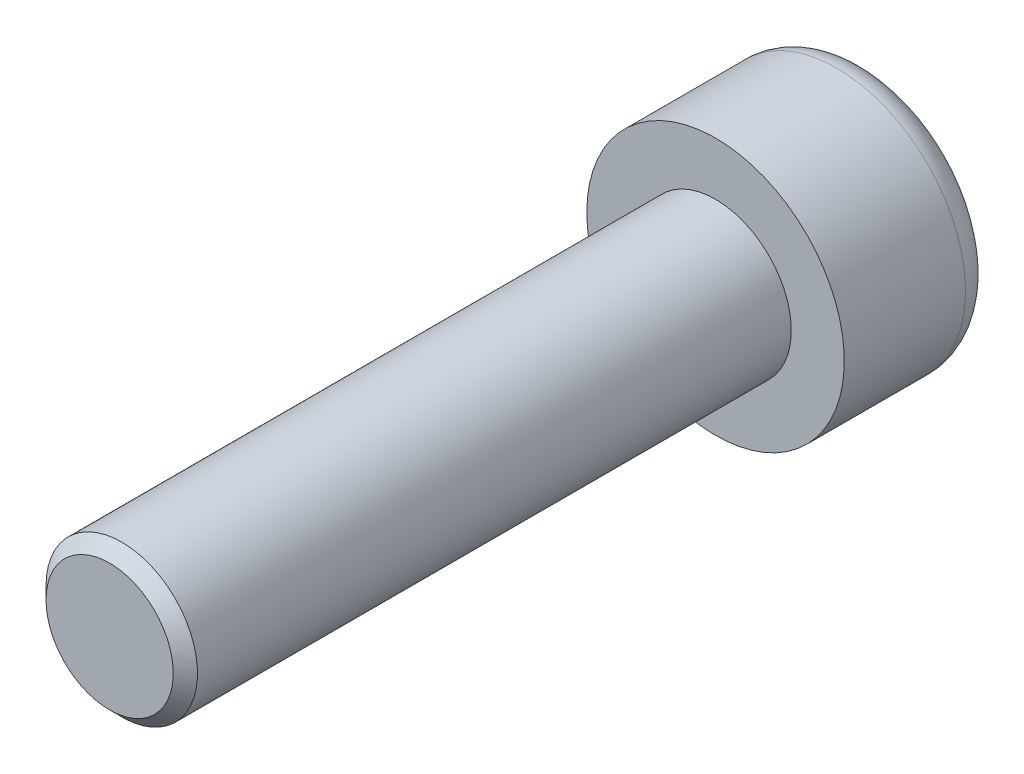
ISO-10303-21;
HEADER;
FILE_DESCRIPTION(('STEP AP214'),'2;1');
FILE_NAME('part.step','',(''),(''),'','','');
FILE_SCHEMA(('AUTOMOTIVE_DESIGN { 1 0 10303 214 1 1 1 1 }'));
ENDSEC;
DATA;
#1=APPLICATION_CONTEXT('core data for automotive mechanical design processes');
#2=APPLICATION_PROTOCOL_DEFINITION('international standard','automotive_design',2000,#1);
#3=PRODUCT_CONTEXT('',#1,'mechanical');
#4=PRODUCT('Part','Part','',(#3));
#5=PRODUCT_RELATED_PRODUCT_CATEGORY('part','',(#4));
#6=PRODUCT_DEFINITION_FORMATION('','',#4);
#7=PRODUCT_DEFINITION_CONTEXT('part definition',#1,'design');
#8=PRODUCT_DEFINITION('design','',#6,#7);
#9=PRODUCT_DEFINITION_SHAPE('','',#8);
#10=(LENGTH_UNIT() NAMED_UNIT(*) SI_UNIT(.MILLI.,.METRE.));
#11=(NAMED_UNIT(*) PLANE_ANGLE_UNIT() SI_UNIT($,.RADIAN.));
#12=(NAMED_UNIT(*) SI_UNIT($,.STERADIAN.) SOLID_ANGLE_UNIT());
#13=UNCERTAINTY_MEASURE_WITH_UNIT(LENGTH_MEASURE(1.E-05),#10,'distance_accuracy_value','');
#14=(GEOMETRIC_REPRESENTATION_CONTEXT(3) GLOBAL_UNCERTAINTY_ASSIGNED_CONTEXT((#13)) GLOBAL_UNIT_ASSIGNED_CONTEXT((#10,
#11,#12)) REPRESENTATION_CONTEXT('',''));
#15=CARTESIAN_POINT('',(0.,0.,0.));
#16=DIRECTION('',(0.,0.,1.));
#17=DIRECTION('',(1.,0.,0.));
#18=AXIS2_PLACEMENT_3D('',#15,#16,#17);
#19=CARTESIAN_POINT('',(-3.99999999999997,0.,3.125));
#20=DIRECTION('',(0.,0.,1.));
#21=DIRECTION('',(1.,0.,0.));
#22=AXIS2_PLACEMENT_3D('',#19,#20,#21);
#23=PLANE('',#22);
#24=DIRECTION('',(-0.866025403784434,0.500000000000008,0.));
#25=VECTOR('',#24,1.);
#26=CARTESIAN_POINT('',(0.,2.30940107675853,3.125));
#27=LINE('',#26,#25);
#28=CARTESIAN_POINT('',(0.,2.30940107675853,3.125));
#29=VERTEX_POINT('',#28);
#30=CARTESIAN_POINT('',(2.,1.15470053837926,3.125));
#31=VERTEX_POINT('',#30);
#32=EDGE_CURVE('E65',#29,#31,#27,.F.);
#33=ORIENTED_EDGE('',*,*,#32,.T.);
#34=DIRECTION('',(0.,1.,0.));
#35=VECTOR('',#34,1.);
#36=CARTESIAN_POINT('',(2.,1.15470053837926,3.125));
#37=LINE('',#36,#35);
#38=CARTESIAN_POINT('',(2.,-1.15470053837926,3.125));
#39=VERTEX_POINT('',#38);
#40=EDGE_CURVE('E62',#31,#39,#37,.F.);
#41=ORIENTED_EDGE('',*,*,#40,.T.);
#42=DIRECTION('',(0.866025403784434,0.500000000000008,0.));
#43=VECTOR('',#42,1.);
#44=CARTESIAN_POINT('',(2.,-1.15470053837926,3.125));
#45=LINE('',#44,#43);
#46=CARTESIAN_POINT('',(0.,-2.30940107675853,3.125));
#47=VERTEX_POINT('',#46);
#48=EDGE_CURVE('E59',#39,#47,#45,.F.);
#49=ORIENTED_EDGE('',*,*,#48,.T.);
#50=DIRECTION('',(0.866025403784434,-0.500000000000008,0.));
#51=VECTOR('',#50,1.);
#52=CARTESIAN_POINT('',(-2.,-1.15470053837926,3.125));
#53=LINE('',#52,#51);
#54=CARTESIAN_POINT('',(-2.,-1.15470053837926,3.125));
#55=VERTEX_POINT('',#54);
#56=EDGE_CURVE('E86',#47,#55,#53,.F.);
#57=ORIENTED_EDGE('',*,*,#56,.T.);
#58=DIRECTION('',(0.,1.,0.));
#59=VECTOR('',#58,1.);
#60=CARTESIAN_POINT('',(-2.,1.15470053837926,3.125));
#61=LINE('',#60,#59);
#62=CARTESIAN_POINT('',(-2.,1.15470053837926,3.125));
#63=VERTEX_POINT('',#62);
#64=EDGE_CURVE('E284',#55,#63,#61,.T.);
#65=ORIENTED_EDGE('',*,*,#64,.T.);
#66=DIRECTION('',(-0.866025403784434,-0.500000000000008,0.));
#67=VECTOR('',#66,1.);
#68=CARTESIAN_POINT('',(0.,2.30940107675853,3.125));
#69=LINE('',#68,#67);
#70=EDGE_CURVE('E291',#63,#29,#69,.F.);
#71=ORIENTED_EDGE('',*,*,#70,.T.);
#72=EDGE_LOOP('',(#33,#41,#49,#57,#65,#71));
#73=FACE_BOUND('',#72,.T.);
#74=ADVANCED_FACE('F16',(#73),#23,.F.);
#75=CARTESIAN_POINT('',(2.,1.15470053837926,3.125));
#76=DIRECTION('',(1.,0.,0.));
#77=DIRECTION('',(0.,0.,-1.));
#78=AXIS2_PLACEMENT_3D('',#75,#76,#77);
#79=PLANE('',#78);
#80=DIRECTION('',(0.,0.,1.));
#81=VECTOR('',#80,1.);
#82=CARTESIAN_POINT('',(2.,-1.15470053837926,3.125));
#83=LINE('',#82,#81);
#84=CARTESIAN_POINT('',(2.,-1.15470053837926,0.));
#85=VERTEX_POINT('',#84);
#86=EDGE_CURVE('E69',#85,#39,#83,.T.);
#87=ORIENTED_EDGE('',*,*,#86,.T.);
#88=ORIENTED_EDGE('',*,*,#40,.F.);
#89=DIRECTION('',(0.,0.,1.));
#90=VECTOR('',#89,1.);
#91=CARTESIAN_POINT('',(2.,1.15470053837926,3.125));
#92=LINE('',#91,#90);
#93=CARTESIAN_POINT('',(2.,1.15470053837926,0.));
#94=VERTEX_POINT('',#93);
#95=EDGE_CURVE('E122',#31,#94,#92,.F.);
#96=ORIENTED_EDGE('',*,*,#95,.T.);
#97=DIRECTION('',(0.,1.,0.));
#98=VECTOR('',#97,1.);
#99=CARTESIAN_POINT('',(2.,0.,0.));
#100=LINE('',#99,#98);
#101=EDGE_CURVE('E76',#94,#85,#100,.F.);
#102=ORIENTED_EDGE('',*,*,#101,.T.);
#103=EDGE_LOOP('',(#87,#88,#96,#102));
#104=FACE_BOUND('',#103,.T.);
#105=ADVANCED_FACE('F73',(#104),#79,.F.);
#106=CARTESIAN_POINT('',(2.,-1.15470053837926,3.125));
#107=DIRECTION('',(0.500000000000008,-0.866025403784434,0.));
#108=DIRECTION('',(0.866025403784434,0.500000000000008,0.));
#109=AXIS2_PLACEMENT_3D('',#106,#107,#108);
#110=PLANE('',#109);
#111=DIRECTION('',(0.,0.,1.));
#112=VECTOR('',#111,1.);
#113=CARTESIAN_POINT('',(0.,-2.30940107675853,3.125));
#114=LINE('',#113,#112);
#115=CARTESIAN_POINT('',(0.,-2.30940107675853,0.));
#116=VERTEX_POINT('',#115);
#117=EDGE_CURVE('E83',#116,#47,#114,.T.);
#118=ORIENTED_EDGE('',*,*,#117,.T.);
#119=ORIENTED_EDGE('',*,*,#48,.F.);
#120=ORIENTED_EDGE('',*,*,#86,.F.);
#121=DIRECTION('',(-0.866025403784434,-0.500000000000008,0.));
#122=VECTOR('',#121,1.);
#123=CARTESIAN_POINT('',(2.,-1.15470053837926,0.));
#124=LINE('',#123,#122);
#125=EDGE_CURVE('E120',#85,#116,#124,.T.);
#126=ORIENTED_EDGE('',*,*,#125,.T.);
#127=EDGE_LOOP('',(#118,#119,#120,#126));
#128=FACE_BOUND('',#127,.T.);
#129=ADVANCED_FACE('F81',(#128),#110,.F.);
#130=CARTESIAN_POINT('',(-2.,-1.15470053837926,3.125));
#131=DIRECTION('',(-0.500000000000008,-0.866025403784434,0.));
#132=DIRECTION('',(0.866025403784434,-0.500000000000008,0.));
#133=AXIS2_PLACEMENT_3D('',#130,#131,#132);
#134=PLANE('',#133);
#135=DIRECTION('',(0.,0.,1.));
#136=VECTOR('',#135,1.);
#137=CARTESIAN_POINT('',(-2.,-1.15470053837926,3.125));
#138=LINE('',#137,#136);
#139=CARTESIAN_POINT('',(-2.,-1.15470053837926,0.));
#140=VERTEX_POINT('',#139);
#141=EDGE_CURVE('E279',#140,#55,#138,.T.);
#142=ORIENTED_EDGE('',*,*,#141,.T.);
#143=ORIENTED_EDGE('',*,*,#56,.F.);
#144=ORIENTED_EDGE('',*,*,#117,.F.);
#145=DIRECTION('',(-0.866025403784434,0.500000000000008,0.));
#146=VECTOR('',#145,1.);
#147=CARTESIAN_POINT('',(0.,-2.30940107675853,0.));
#148=LINE('',#147,#146);
#149=EDGE_CURVE('E117',#116,#140,#148,.T.);
#150=ORIENTED_EDGE('',*,*,#149,.T.);
#151=EDGE_LOOP('',(#142,#143,#144,#150));
#152=FACE_BOUND('',#151,.T.);
#153=ADVANCED_FACE('F234',(#152),#134,.F.);
#154=CARTESIAN_POINT('',(-2.,1.15470053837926,3.125));
#155=DIRECTION('',(-1.,0.,0.));
#156=DIRECTION('',(0.,0.,1.));
#157=AXIS2_PLACEMENT_3D('',#154,#155,#156);
#158=PLANE('',#157);
#159=DIRECTION('',(0.,0.,1.));
#160=VECTOR('',#159,1.);
#161=CARTESIAN_POINT('',(-2.,1.15470053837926,3.125));
#162=LINE('',#161,#160);
#163=CARTESIAN_POINT('',(-2.,1.15470053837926,0.));
#164=VERTEX_POINT('',#163);
#165=EDGE_CURVE('E288',#164,#63,#162,.T.);
#166=ORIENTED_EDGE('',*,*,#165,.T.);
#167=ORIENTED_EDGE('',*,*,#64,.F.);
#168=ORIENTED_EDGE('',*,*,#141,.F.);
#169=DIRECTION('',(0.,1.,0.));
#170=VECTOR('',#169,1.);
#171=CARTESIAN_POINT('',(-2.,0.,0.));
#172=LINE('',#171,#170);
#173=EDGE_CURVE('E108',#140,#164,#172,.T.);
#174=ORIENTED_EDGE('',*,*,#173,.T.);
#175=EDGE_LOOP('',(#166,#167,#168,#174));
#176=FACE_BOUND('',#175,.T.);
#177=ADVANCED_FACE('F224',(#176),#158,.F.);
#178=CARTESIAN_POINT('',(0.,2.30940107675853,3.125));
#179=DIRECTION('',(-0.500000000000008,0.866025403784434,0.));
#180=DIRECTION('',(-0.866025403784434,-0.500000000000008,0.));
#181=AXIS2_PLACEMENT_3D('',#178,#179,#180);
#182=PLANE('',#181);
#183=DIRECTION('',(0.,0.,1.));
#184=VECTOR('',#183,1.);
#185=CARTESIAN_POINT('',(0.,2.30940107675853,3.125));
#186=LINE('',#185,#184);
#187=CARTESIAN_POINT('',(0.,2.30940107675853,0.));
#188=VERTEX_POINT('',#187);
#189=EDGE_CURVE('E295',#188,#29,#186,.T.);
#190=ORIENTED_EDGE('',*,*,#189,.T.);
#191=ORIENTED_EDGE('',*,*,#70,.F.);
#192=ORIENTED_EDGE('',*,*,#165,.F.);
#193=DIRECTION('',(0.866025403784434,0.500000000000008,0.));
#194=VECTOR('',#193,1.);
#195=CARTESIAN_POINT('',(-2.,1.15470053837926,0.));
#196=LINE('',#195,#194);
#197=EDGE_CURVE('E102',#164,#188,#196,.T.);
#198=ORIENTED_EDGE('',*,*,#197,.T.);
#199=EDGE_LOOP('',(#190,#191,#192,#198));
#200=FACE_BOUND('',#199,.T.);
#201=ADVANCED_FACE('F163',(#200),#182,.F.);
#202=CARTESIAN_POINT('',(0.,2.30940107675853,3.125));
#203=DIRECTION('',(0.500000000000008,0.866025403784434,0.));
#204=DIRECTION('',(-0.866025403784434,0.500000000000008,0.));
#205=AXIS2_PLACEMENT_3D('',#202,#203,#204);
#206=PLANE('',#205);
#207=ORIENTED_EDGE('',*,*,#95,.F.);
#208=ORIENTED_EDGE('',*,*,#32,.F.);
#209=ORIENTED_EDGE('',*,*,#189,.F.);
#210=DIRECTION('',(0.866025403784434,-0.500000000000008,0.));
#211=VECTOR('',#210,1.);
#212=CARTESIAN_POINT('',(0.,2.30940107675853,0.));
#213=LINE('',#212,#211);
#214=EDGE_CURVE('E100',#188,#94,#213,.T.);
#215=ORIENTED_EDGE('',*,*,#214,.T.);
#216=EDGE_LOOP('',(#207,#208,#209,#215));
#217=FACE_BOUND('',#216,.T.);
#218=ADVANCED_FACE('F157',(#217),#206,.F.);
#219=CARTESIAN_POINT('',(0.,0.,0.));
#220=DIRECTION('',(0.,0.,1.));
#221=DIRECTION('',(1.,0.,0.));
#222=AXIS2_PLACEMENT_3D('',#219,#220,#221);
#223=PLANE('',#222);
#224=ORIENTED_EDGE('',*,*,#197,.F.);
#225=ORIENTED_EDGE('',*,*,#173,.F.);
#226=ORIENTED_EDGE('',*,*,#149,.F.);
#227=ORIENTED_EDGE('',*,*,#125,.F.);
#228=ORIENTED_EDGE('',*,*,#101,.F.);
#229=ORIENTED_EDGE('',*,*,#214,.F.);
#230=EDGE_LOOP('',(#224,#225,#226,#227,#228,#229));
#231=FACE_BOUND('',#230,.T.);
#232=CARTESIAN_POINT('',(0.,0.,0.));
#233=DIRECTION('',(0.,0.,1.));
#234=DIRECTION('',(1.,0.,0.));
#235=AXIS2_PLACEMENT_3D('',#232,#233,#234);
#236=CIRCLE('',#235,3.25);
#237=CARTESIAN_POINT('',(3.25,0.,0.));
#238=VERTEX_POINT('',#237);
#239=CARTESIAN_POINT('',(-3.25,0.,0.));
#240=VERTEX_POINT('',#239);
#241=EDGE_CURVE('E98',#238,#240,#236,.T.);
#242=ORIENTED_EDGE('',*,*,#241,.F.);
#243=CARTESIAN_POINT('',(0.,0.,0.));
#244=DIRECTION('',(0.,0.,1.));
#245=DIRECTION('',(-1.,0.,0.));
#246=AXIS2_PLACEMENT_3D('',#243,#244,#245);
#247=CIRCLE('',#246,3.25);
#248=EDGE_CURVE('E35',#240,#238,#247,.T.);
#249=ORIENTED_EDGE('',*,*,#248,.F.);
#250=EDGE_LOOP('',(#242,#249));
#251=FACE_BOUND('',#250,.T.);
#252=ADVANCED_FACE('F138',(#231,#251),#223,.F.);
#253=CARTESIAN_POINT('',(0.,0.,1.));
#254=DIRECTION('',(0.,0.,1.));
#255=DIRECTION('',(1.,0.,0.));
#256=AXIS2_PLACEMENT_3D('',#253,#254,#255);
#257=TOROIDAL_SURFACE('',#256,3.25,1.);
#258=CARTESIAN_POINT('',(0.,0.,1.));
#259=DIRECTION('',(0.,0.,-1.));
#260=DIRECTION('',(-1.,0.,0.));
#261=AXIS2_PLACEMENT_3D('',#258,#259,#260);
#262=CIRCLE('',#261,4.25);
#263=CARTESIAN_POINT('',(-4.25,0.,1.));
#264=VERTEX_POINT('',#263);
#265=EDGE_CURVE('E95',#264,#264,#262,.F.);
#266=ORIENTED_EDGE('',*,*,#265,.F.);
#267=EDGE_LOOP('',(#266));
#268=FACE_BOUND('',#267,.T.);
#269=ORIENTED_EDGE('',*,*,#241,.T.);
#270=ORIENTED_EDGE('',*,*,#248,.T.);
#271=EDGE_LOOP('',(#269,#270));
#272=FACE_BOUND('',#271,.T.);
#273=ADVANCED_FACE('F97',(#268,#272),#257,.T.);
#274=CARTESIAN_POINT('',(0.,0.,25.));
#275=DIRECTION('',(0.,0.,1.));
#276=DIRECTION('',(1.,0.,0.));
#277=AXIS2_PLACEMENT_3D('',#274,#275,#276);
#278=PLANE('',#277);
#279=CARTESIAN_POINT('',(0.,0.,24.9999999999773));
#280=DIRECTION('',(0.,0.,-1.));
#281=DIRECTION('',(-1.,0.,0.));
#282=AXIS2_PLACEMENT_3D('',#279,#280,#281);
#283=CIRCLE('',#282,2.09999999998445);
#284=CARTESIAN_POINT('',(-2.09999999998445,0.,24.9999999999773));
#285=VERTEX_POINT('',#284);
#286=EDGE_CURVE('E93',#285,#285,#283,.T.);
#287=ORIENTED_EDGE('',*,*,#286,.F.);
#288=EDGE_LOOP('',(#287));
#289=FACE_BOUND('',#288,.T.);
#290=ADVANCED_FACE('F137',(#289),#278,.T.);
#291=CARTESIAN_POINT('',(0.,0.,5.));
#292=DIRECTION('',(0.,0.,-1.));
#293=DIRECTION('',(-1.,0.,0.));
#294=AXIS2_PLACEMENT_3D('',#291,#292,#293);
#295=CYLINDRICAL_SURFACE('',#294,4.25);
#296=ORIENTED_EDGE('',*,*,#265,.T.);
#297=EDGE_LOOP('',(#296));
#298=FACE_BOUND('',#297,.T.);
#299=CARTESIAN_POINT('',(0.,0.,5.));
#300=DIRECTION('',(0.,0.,-1.));
#301=DIRECTION('',(-1.,0.,0.));
#302=AXIS2_PLACEMENT_3D('',#299,#300,#301);
#303=CIRCLE('',#302,4.25);
#304=CARTESIAN_POINT('',(-4.25,0.,5.));
#305=VERTEX_POINT('',#304);
#306=EDGE_CURVE('E90',#305,#305,#303,.F.);
#307=ORIENTED_EDGE('',*,*,#306,.F.);
#308=EDGE_LOOP('',(#307));
#309=FACE_BOUND('',#308,.T.);
#310=ADVANCED_FACE('F179',(#298,#309),#295,.T.);
#311=CARTESIAN_POINT('',(0.,0.,24.599999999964));
#312=DIRECTION('',(0.,0.,-1.));
#313=DIRECTION('',(-1.,0.,0.));
#314=AXIS2_PLACEMENT_3D('',#311,#312,#313);
#315=CONICAL_SURFACE('',#314,2.49999999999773,0.785398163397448);
#316=CARTESIAN_POINT('',(0.,0.,24.6));
#317=DIRECTION('',(0.,0.,-1.));
#318=DIRECTION('',(-1.,0.,0.));
#319=AXIS2_PLACEMENT_3D('',#316,#317,#318);
#320=CIRCLE('',#319,2.5);
#321=CARTESIAN_POINT('',(-2.5,0.,24.6));
#322=VERTEX_POINT('',#321);
#323=EDGE_CURVE('E27',#322,#322,#320,.T.);
#324=ORIENTED_EDGE('',*,*,#323,.F.);
#325=EDGE_LOOP('',(#324));
#326=FACE_BOUND('',#325,.T.);
#327=ORIENTED_EDGE('',*,*,#286,.T.);
#328=EDGE_LOOP('',(#327));
#329=FACE_BOUND('',#328,.T.);
#330=ADVANCED_FACE('F173',(#326,#329),#315,.T.);
#331=CARTESIAN_POINT('',(0.,0.,5.));
#332=DIRECTION('',(0.,0.,1.));
#333=DIRECTION('',(1.,0.,0.));
#334=AXIS2_PLACEMENT_3D('',#331,#332,#333);
#335=PLANE('',#334);
#336=CARTESIAN_POINT('',(0.,0.,5.));
#337=DIRECTION('',(0.,0.,-1.));
#338=DIRECTION('',(-1.,0.,0.));
#339=AXIS2_PLACEMENT_3D('',#336,#337,#338);
#340=CIRCLE('',#339,2.5);
#341=CARTESIAN_POINT('',(-2.5,0.,5.));
#342=VERTEX_POINT('',#341);
#343=EDGE_CURVE('E11',#342,#342,#340,.F.);
#344=ORIENTED_EDGE('',*,*,#343,.F.);
#345=EDGE_LOOP('',(#344));
#346=FACE_BOUND('',#345,.T.);
#347=ORIENTED_EDGE('',*,*,#306,.T.);
#348=EDGE_LOOP('',(#347));
#349=FACE_BOUND('',#348,.T.);
#350=ADVANCED_FACE('F167',(#346,#349),#335,.T.);
#351=CARTESIAN_POINT('',(0.,0.,25.));
#352=DIRECTION('',(0.,0.,-1.));
#353=DIRECTION('',(-1.,0.,0.));
#354=AXIS2_PLACEMENT_3D('',#351,#352,#353);
#355=CYLINDRICAL_SURFACE('',#354,2.5);
#356=ORIENTED_EDGE('',*,*,#343,.T.);
#357=EDGE_LOOP('',(#356));
#358=FACE_BOUND('',#357,.T.);
#359=ORIENTED_EDGE('',*,*,#323,.T.);
#360=EDGE_LOOP('',(#359));
#361=FACE_BOUND('',#360,.T.);
#362=ADVANCED_FACE('F165',(#358,#361),#355,.T.);
#363=CLOSED_SHELL('',(#74,#105,#129,#153,#177,#201,#218,#252,#273,#290,#310,#330,#350,#362));
#364=MANIFOLD_SOLID_BREP('B1',#363);
#365=ADVANCED_BREP_SHAPE_REPRESENTATION('',(#18,#364),#14);
#366=SHAPE_DEFINITION_REPRESENTATION(#9,#365);
ENDSEC;
END-ISO-10303-21;
